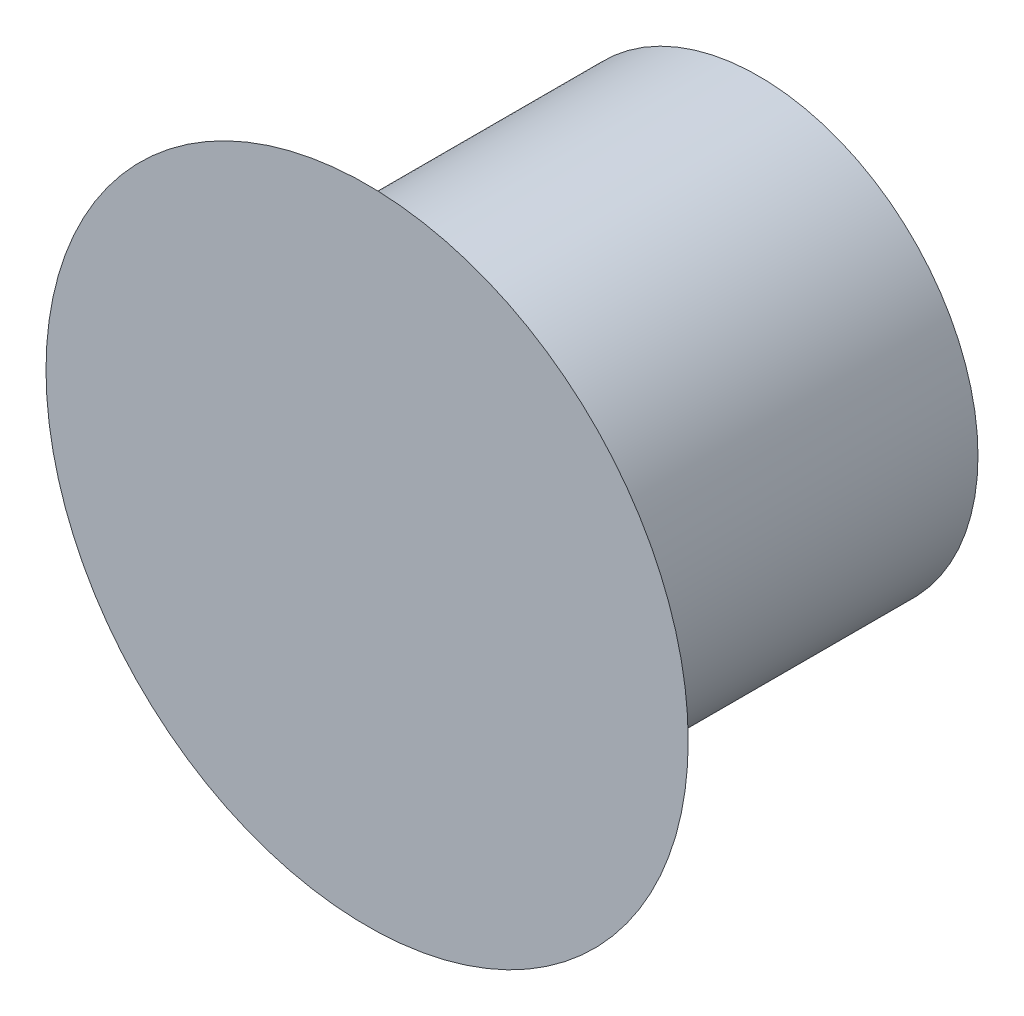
ISO-10303-21;
HEADER;
FILE_DESCRIPTION(('STEP AP214'),'2;1');
FILE_NAME('part.step','',(''),(''),'','','');
FILE_SCHEMA(('AUTOMOTIVE_DESIGN { 1 0 10303 214 1 1 1 1 }'));
ENDSEC;
DATA;
#1=APPLICATION_CONTEXT('core data for automotive mechanical design processes');
#2=APPLICATION_PROTOCOL_DEFINITION('international standard','automotive_design',2000,#1);
#3=PRODUCT_CONTEXT('',#1,'mechanical');
#4=PRODUCT('Part','Part','',(#3));
#5=PRODUCT_RELATED_PRODUCT_CATEGORY('part','',(#4));
#6=PRODUCT_DEFINITION_FORMATION('','',#4);
#7=PRODUCT_DEFINITION_CONTEXT('part definition',#1,'design');
#8=PRODUCT_DEFINITION('design','',#6,#7);
#9=PRODUCT_DEFINITION_SHAPE('','',#8);
#10=(LENGTH_UNIT() NAMED_UNIT(*) SI_UNIT(.MILLI.,.METRE.));
#11=(NAMED_UNIT(*) PLANE_ANGLE_UNIT() SI_UNIT($,.RADIAN.));
#12=(NAMED_UNIT(*) SI_UNIT($,.STERADIAN.) SOLID_ANGLE_UNIT());
#13=UNCERTAINTY_MEASURE_WITH_UNIT(LENGTH_MEASURE(1.E-05),#10,'distance_accuracy_value','');
#14=(GEOMETRIC_REPRESENTATION_CONTEXT(3) GLOBAL_UNCERTAINTY_ASSIGNED_CONTEXT((#13)) GLOBAL_UNIT_ASSIGNED_CONTEXT((#10,
#11,#12)) REPRESENTATION_CONTEXT('',''));
#15=CARTESIAN_POINT('',(0.,0.,0.));
#16=DIRECTION('',(0.,0.,1.));
#17=DIRECTION('',(1.,0.,0.));
#18=AXIS2_PLACEMENT_3D('',#15,#16,#17);
#19=CARTESIAN_POINT('',(0.,0.,12.5));
#20=DIRECTION('',(0.,0.,-1.));
#21=DIRECTION('',(-1.,0.,0.));
#22=AXIS2_PLACEMENT_3D('',#19,#20,#21);
#23=PLANE('',#22);
#24=CARTESIAN_POINT('',(0.,0.,12.5000000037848));
#25=DIRECTION('',(0.,0.,1.));
#26=DIRECTION('',(1.,0.,0.));
#27=AXIS2_PLACEMENT_3D('',#24,#25,#26);
#28=CIRCLE('',#27,20.4999999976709);
#29=CARTESIAN_POINT('',(20.4999999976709,0.,12.5000000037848));
#30=VERTEX_POINT('',#29);
#31=EDGE_CURVE('E16',#30,#30,#28,.F.);
#32=ORIENTED_EDGE('',*,*,#31,.F.);
#33=EDGE_LOOP('',(#32));
#34=FACE_BOUND('',#33,.T.);
#35=ADVANCED_FACE('F13',(#34),#23,.F.);
#36=CARTESIAN_POINT('',(0.,0.,12.5000000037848));
#37=DIRECTION('',(0.,0.,1.));
#38=DIRECTION('',(1.,0.,0.));
#39=AXIS2_PLACEMENT_3D('',#36,#37,#38);
#40=CONICAL_SURFACE('',#39,20.4999999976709,1.01914134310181);
#41=ORIENTED_EDGE('',*,*,#31,.T.);
#42=EDGE_LOOP('',(#41));
#43=FACE_BOUND('',#42,.T.);
#44=CARTESIAN_POINT('',(0.,0.,8.5));
#45=DIRECTION('',(0.,0.,1.));
#46=DIRECTION('',(1.,0.,0.));
#47=AXIS2_PLACEMENT_3D('',#44,#45,#46);
#48=CIRCLE('',#47,14.);
#49=CARTESIAN_POINT('',(14.,0.,8.5));
#50=VERTEX_POINT('',#49);
#51=EDGE_CURVE('E20',#50,#50,#48,.F.);
#52=ORIENTED_EDGE('',*,*,#51,.F.);
#53=EDGE_LOOP('',(#52));
#54=FACE_BOUND('',#53,.T.);
#55=ADVANCED_FACE('F32',(#43,#54),#40,.T.);
#56=CARTESIAN_POINT('',(0.,0.,-12.5));
#57=DIRECTION('',(0.,0.,-1.));
#58=DIRECTION('',(-1.,0.,0.));
#59=AXIS2_PLACEMENT_3D('',#56,#57,#58);
#60=PLANE('',#59);
#61=CARTESIAN_POINT('',(0.,0.,-12.5));
#62=DIRECTION('',(0.,0.,1.));
#63=DIRECTION('',(1.,0.,0.));
#64=AXIS2_PLACEMENT_3D('',#61,#62,#63);
#65=CIRCLE('',#64,14.);
#66=CARTESIAN_POINT('',(14.,0.,-12.5));
#67=VERTEX_POINT('',#66);
#68=EDGE_CURVE('E8',#67,#67,#65,.T.);
#69=ORIENTED_EDGE('',*,*,#68,.F.);
#70=EDGE_LOOP('',(#69));
#71=FACE_BOUND('',#70,.T.);
#72=ADVANCED_FACE('F40',(#71),#60,.T.);
#73=CARTESIAN_POINT('',(0.,0.,0.));
#74=DIRECTION('',(0.,0.,1.));
#75=DIRECTION('',(1.,0.,0.));
#76=AXIS2_PLACEMENT_3D('',#73,#74,#75);
#77=CYLINDRICAL_SURFACE('',#76,14.);
#78=ORIENTED_EDGE('',*,*,#68,.T.);
#79=EDGE_LOOP('',(#78));
#80=FACE_BOUND('',#79,.T.);
#81=ORIENTED_EDGE('',*,*,#51,.T.);
#82=EDGE_LOOP('',(#81));
#83=FACE_BOUND('',#82,.T.);
#84=ADVANCED_FACE('F41',(#80,#83),#77,.T.);
#85=CLOSED_SHELL('',(#35,#55,#72,#84));
#86=MANIFOLD_SOLID_BREP('B1',#85);
#87=ADVANCED_BREP_SHAPE_REPRESENTATION('',(#18,#86),#14);
#88=SHAPE_DEFINITION_REPRESENTATION(#9,#87);
ENDSEC;
END-ISO-10303-21;
